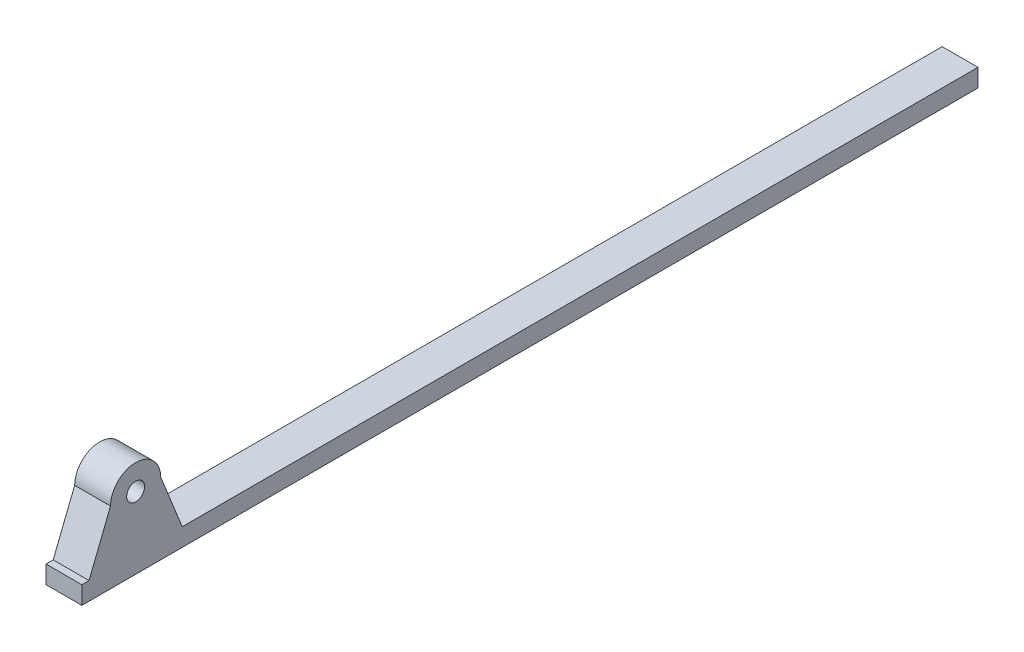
ISO-10303-21;
HEADER;
FILE_DESCRIPTION(('STEP AP214'),'2;1');
FILE_NAME('part.step','',(''),(''),'','','');
FILE_SCHEMA(('AUTOMOTIVE_DESIGN { 1 0 10303 214 1 1 1 1 }'));
ENDSEC;
DATA;
#1=APPLICATION_CONTEXT('core data for automotive mechanical design processes');
#2=APPLICATION_PROTOCOL_DEFINITION('international standard','automotive_design',2000,#1);
#3=PRODUCT_CONTEXT('',#1,'mechanical');
#4=PRODUCT('Part','Part','',(#3));
#5=PRODUCT_RELATED_PRODUCT_CATEGORY('part','',(#4));
#6=PRODUCT_DEFINITION_FORMATION('','',#4);
#7=PRODUCT_DEFINITION_CONTEXT('part definition',#1,'design');
#8=PRODUCT_DEFINITION('design','',#6,#7);
#9=PRODUCT_DEFINITION_SHAPE('','',#8);
#10=(LENGTH_UNIT() NAMED_UNIT(*) SI_UNIT(.MILLI.,.METRE.));
#11=(NAMED_UNIT(*) PLANE_ANGLE_UNIT() SI_UNIT($,.RADIAN.));
#12=(NAMED_UNIT(*) SI_UNIT($,.STERADIAN.) SOLID_ANGLE_UNIT());
#13=UNCERTAINTY_MEASURE_WITH_UNIT(LENGTH_MEASURE(1.E-05),#10,'distance_accuracy_value','');
#14=(GEOMETRIC_REPRESENTATION_CONTEXT(3) GLOBAL_UNCERTAINTY_ASSIGNED_CONTEXT((#13)) GLOBAL_UNIT_ASSIGNED_CONTEXT((#10,
#11,#12)) REPRESENTATION_CONTEXT('',''));
#15=CARTESIAN_POINT('',(0.,0.,0.));
#16=DIRECTION('',(0.,0.,1.));
#17=DIRECTION('',(1.,0.,0.));
#18=AXIS2_PLACEMENT_3D('',#15,#16,#17);
#19=CARTESIAN_POINT('',(5.,17.5,110.));
#20=DIRECTION('',(1.,0.,0.));
#21=DIRECTION('',(0.,0.,-1.));
#22=AXIS2_PLACEMENT_3D('',#19,#20,#21);
#23=PLANE('',#22);
#24=DIRECTION('',(0.,0.,1.));
#25=VECTOR('',#24,1.);
#26=CARTESIAN_POINT('',(5.,2.49999999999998,123.));
#27=LINE('',#26,#25);
#28=CARTESIAN_POINT('',(5.,2.49999999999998,123.));
#29=VERTEX_POINT('',#28);
#30=CARTESIAN_POINT('',(5.,2.49999999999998,125.));
#31=VERTEX_POINT('',#30);
#32=EDGE_CURVE('E155',#29,#31,#27,.T.);
#33=ORIENTED_EDGE('',*,*,#32,.T.);
#34=DIRECTION('',(0.,-1.,0.));
#35=VECTOR('',#34,1.);
#36=CARTESIAN_POINT('',(5.,-2.50000000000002,125.));
#37=LINE('',#36,#35);
#38=CARTESIAN_POINT('',(5.,-2.50000000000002,125.));
#39=VERTEX_POINT('',#38);
#40=EDGE_CURVE('E103',#31,#39,#37,.T.);
#41=ORIENTED_EDGE('',*,*,#40,.T.);
#42=DIRECTION('',(0.,0.,-1.));
#43=VECTOR('',#42,1.);
#44=CARTESIAN_POINT('',(5.,-2.49999999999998,-125.));
#45=LINE('',#44,#43);
#46=CARTESIAN_POINT('',(5.,-2.49999999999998,-125.));
#47=VERTEX_POINT('',#46);
#48=EDGE_CURVE('E170',#39,#47,#45,.T.);
#49=ORIENTED_EDGE('',*,*,#48,.T.);
#50=DIRECTION('',(0.,1.,0.));
#51=VECTOR('',#50,1.);
#52=CARTESIAN_POINT('',(5.,-2.49999999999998,-125.));
#53=LINE('',#52,#51);
#54=CARTESIAN_POINT('',(5.,2.50000000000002,-125.));
#55=VERTEX_POINT('',#54);
#56=EDGE_CURVE('E183',#47,#55,#53,.T.);
#57=ORIENTED_EDGE('',*,*,#56,.T.);
#58=DIRECTION('',(0.,0.,1.));
#59=VECTOR('',#58,1.);
#60=CARTESIAN_POINT('',(5.,2.50000000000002,-125.));
#61=LINE('',#60,#59);
#62=CARTESIAN_POINT('',(5.,2.49999999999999,97.));
#63=VERTEX_POINT('',#62);
#64=EDGE_CURVE('E122',#55,#63,#61,.T.);
#65=ORIENTED_EDGE('',*,*,#64,.T.);
#66=DIRECTION('',(0.,0.92847669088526,0.371390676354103));
#67=VECTOR('',#66,1.);
#68=CARTESIAN_POINT('',(5.,17.5,103.));
#69=LINE('',#68,#67);
#70=CARTESIAN_POINT('',(5.,17.5,103.));
#71=VERTEX_POINT('',#70);
#72=EDGE_CURVE('E116',#63,#71,#69,.T.);
#73=ORIENTED_EDGE('',*,*,#72,.T.);
#74=CARTESIAN_POINT('',(5.,17.5,110.));
#75=DIRECTION('',(1.,0.,0.));
#76=DIRECTION('',(0.,0.,-1.));
#77=AXIS2_PLACEMENT_3D('',#74,#75,#76);
#78=CIRCLE('',#77,7.00000000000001);
#79=CARTESIAN_POINT('',(5.,17.5,117.));
#80=VERTEX_POINT('',#79);
#81=EDGE_CURVE('E120',#71,#80,#78,.T.);
#82=ORIENTED_EDGE('',*,*,#81,.T.);
#83=DIRECTION('',(0.,-0.92847669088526,0.371390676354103));
#84=VECTOR('',#83,1.);
#85=CARTESIAN_POINT('',(5.,17.5,117.));
#86=LINE('',#85,#84);
#87=EDGE_CURVE('E60',#80,#29,#86,.T.);
#88=ORIENTED_EDGE('',*,*,#87,.T.);
#89=EDGE_LOOP('',(#33,#41,#49,#57,#65,#73,#82,#88));
#90=FACE_BOUND('',#89,.T.);
#91=CARTESIAN_POINT('',(5.,17.5,110.));
#92=DIRECTION('',(1.,0.,0.));
#93=DIRECTION('',(0.,0.,-1.));
#94=AXIS2_PLACEMENT_3D('',#91,#92,#93);
#95=CIRCLE('',#94,2.50000000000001);
#96=CARTESIAN_POINT('',(5.,17.5,107.5));
#97=VERTEX_POINT('',#96);
#98=EDGE_CURVE('E144',#97,#97,#95,.T.);
#99=ORIENTED_EDGE('',*,*,#98,.F.);
#100=EDGE_LOOP('',(#99));
#101=FACE_BOUND('',#100,.T.);
#102=ADVANCED_FACE('F43',(#90,#101),#23,.T.);
#103=CARTESIAN_POINT('',(-5.,17.5,110.));
#104=DIRECTION('',(1.,0.,0.));
#105=DIRECTION('',(0.,0.,-1.));
#106=AXIS2_PLACEMENT_3D('',#103,#104,#105);
#107=PLANE('',#106);
#108=DIRECTION('',(0.,0.,1.));
#109=VECTOR('',#108,1.);
#110=CARTESIAN_POINT('',(-5.,2.49999999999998,123.));
#111=LINE('',#110,#109);
#112=CARTESIAN_POINT('',(-5.,2.49999999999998,123.));
#113=VERTEX_POINT('',#112);
#114=CARTESIAN_POINT('',(-5.,2.49999999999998,125.));
#115=VERTEX_POINT('',#114);
#116=EDGE_CURVE('E140',#113,#115,#111,.T.);
#117=ORIENTED_EDGE('',*,*,#116,.F.);
#118=DIRECTION('',(0.,-0.92847669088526,0.371390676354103));
#119=VECTOR('',#118,1.);
#120=CARTESIAN_POINT('',(-5.,17.5,117.));
#121=LINE('',#120,#119);
#122=CARTESIAN_POINT('',(-5.,17.5,117.));
#123=VERTEX_POINT('',#122);
#124=EDGE_CURVE('E95',#123,#113,#121,.T.);
#125=ORIENTED_EDGE('',*,*,#124,.F.);
#126=CARTESIAN_POINT('',(-5.,17.5,110.));
#127=DIRECTION('',(1.,0.,0.));
#128=DIRECTION('',(0.,0.,-1.));
#129=AXIS2_PLACEMENT_3D('',#126,#127,#128);
#130=CIRCLE('',#129,7.00000000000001);
#131=CARTESIAN_POINT('',(-5.,17.5,103.));
#132=VERTEX_POINT('',#131);
#133=EDGE_CURVE('E89',#132,#123,#130,.T.);
#134=ORIENTED_EDGE('',*,*,#133,.F.);
#135=DIRECTION('',(0.,0.92847669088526,0.371390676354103));
#136=VECTOR('',#135,1.);
#137=CARTESIAN_POINT('',(-5.,17.5,103.));
#138=LINE('',#137,#136);
#139=CARTESIAN_POINT('',(-5.,2.49999999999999,97.));
#140=VERTEX_POINT('',#139);
#141=EDGE_CURVE('E130',#140,#132,#138,.T.);
#142=ORIENTED_EDGE('',*,*,#141,.F.);
#143=DIRECTION('',(0.,0.,1.));
#144=VECTOR('',#143,1.);
#145=CARTESIAN_POINT('',(-5.,2.50000000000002,-125.));
#146=LINE('',#145,#144);
#147=CARTESIAN_POINT('',(-5.,2.50000000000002,-125.));
#148=VERTEX_POINT('',#147);
#149=EDGE_CURVE('E150',#148,#140,#146,.T.);
#150=ORIENTED_EDGE('',*,*,#149,.F.);
#151=DIRECTION('',(0.,1.,0.));
#152=VECTOR('',#151,1.);
#153=CARTESIAN_POINT('',(-5.,-2.49999999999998,-125.));
#154=LINE('',#153,#152);
#155=CARTESIAN_POINT('',(-5.,-2.49999999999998,-125.));
#156=VERTEX_POINT('',#155);
#157=EDGE_CURVE('E148',#156,#148,#154,.T.);
#158=ORIENTED_EDGE('',*,*,#157,.F.);
#159=DIRECTION('',(0.,0.,-1.));
#160=VECTOR('',#159,1.);
#161=CARTESIAN_POINT('',(-5.,-2.49999999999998,-125.));
#162=LINE('',#161,#160);
#163=CARTESIAN_POINT('',(-5.,-2.50000000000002,125.));
#164=VERTEX_POINT('',#163);
#165=EDGE_CURVE('E146',#164,#156,#162,.T.);
#166=ORIENTED_EDGE('',*,*,#165,.F.);
#167=DIRECTION('',(0.,-1.,0.));
#168=VECTOR('',#167,1.);
#169=CARTESIAN_POINT('',(-5.,-2.50000000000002,125.));
#170=LINE('',#169,#168);
#171=EDGE_CURVE('E143',#115,#164,#170,.T.);
#172=ORIENTED_EDGE('',*,*,#171,.F.);
#173=EDGE_LOOP('',(#117,#125,#134,#142,#150,#158,#166,#172));
#174=FACE_BOUND('',#173,.T.);
#175=CARTESIAN_POINT('',(-5.,17.5,110.));
#176=DIRECTION('',(1.,0.,0.));
#177=DIRECTION('',(0.,0.,-1.));
#178=AXIS2_PLACEMENT_3D('',#175,#176,#177);
#179=CIRCLE('',#178,2.50000000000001);
#180=CARTESIAN_POINT('',(-5.,17.5,107.5));
#181=VERTEX_POINT('',#180);
#182=EDGE_CURVE('E189',#181,#181,#179,.T.);
#183=ORIENTED_EDGE('',*,*,#182,.T.);
#184=EDGE_LOOP('',(#183));
#185=FACE_BOUND('',#184,.T.);
#186=ADVANCED_FACE('F174',(#174,#185),#107,.F.);
#187=CARTESIAN_POINT('',(5.,2.49999999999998,123.));
#188=DIRECTION('',(0.,-1.,0.));
#189=DIRECTION('',(0.,0.,-1.));
#190=AXIS2_PLACEMENT_3D('',#187,#188,#189);
#191=PLANE('',#190);
#192=ORIENTED_EDGE('',*,*,#116,.T.);
#193=DIRECTION('',(-1.,0.,0.));
#194=VECTOR('',#193,1.);
#195=CARTESIAN_POINT('',(5.,2.49999999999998,125.));
#196=LINE('',#195,#194);
#197=EDGE_CURVE('E11',#31,#115,#196,.T.);
#198=ORIENTED_EDGE('',*,*,#197,.F.);
#199=ORIENTED_EDGE('',*,*,#32,.F.);
#200=DIRECTION('',(-1.,0.,0.));
#201=VECTOR('',#200,1.);
#202=CARTESIAN_POINT('',(5.,2.49999999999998,123.));
#203=LINE('',#202,#201);
#204=EDGE_CURVE('E136',#29,#113,#203,.T.);
#205=ORIENTED_EDGE('',*,*,#204,.T.);
#206=EDGE_LOOP('',(#192,#198,#199,#205));
#207=FACE_BOUND('',#206,.T.);
#208=ADVANCED_FACE('F45',(#207),#191,.F.);
#209=CARTESIAN_POINT('',(5.,-2.50000000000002,125.));
#210=DIRECTION('',(0.,0.,-1.));
#211=DIRECTION('',(-1.,0.,0.));
#212=AXIS2_PLACEMENT_3D('',#209,#210,#211);
#213=PLANE('',#212);
#214=ORIENTED_EDGE('',*,*,#171,.T.);
#215=DIRECTION('',(-1.,0.,0.));
#216=VECTOR('',#215,1.);
#217=CARTESIAN_POINT('',(5.,-2.50000000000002,125.));
#218=LINE('',#217,#216);
#219=EDGE_CURVE('E52',#39,#164,#218,.T.);
#220=ORIENTED_EDGE('',*,*,#219,.F.);
#221=ORIENTED_EDGE('',*,*,#40,.F.);
#222=ORIENTED_EDGE('',*,*,#197,.T.);
#223=EDGE_LOOP('',(#214,#220,#221,#222));
#224=FACE_BOUND('',#223,.T.);
#225=ADVANCED_FACE('F217',(#224),#213,.F.);
#226=CARTESIAN_POINT('',(5.,-2.49999999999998,-125.));
#227=DIRECTION('',(0.,1.,0.));
#228=DIRECTION('',(0.,0.,1.));
#229=AXIS2_PLACEMENT_3D('',#226,#227,#228);
#230=PLANE('',#229);
#231=ORIENTED_EDGE('',*,*,#165,.T.);
#232=DIRECTION('',(-1.,0.,0.));
#233=VECTOR('',#232,1.);
#234=CARTESIAN_POINT('',(5.,-2.49999999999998,-125.));
#235=LINE('',#234,#233);
#236=EDGE_CURVE('E162',#47,#156,#235,.T.);
#237=ORIENTED_EDGE('',*,*,#236,.F.);
#238=ORIENTED_EDGE('',*,*,#48,.F.);
#239=ORIENTED_EDGE('',*,*,#219,.T.);
#240=EDGE_LOOP('',(#231,#237,#238,#239));
#241=FACE_BOUND('',#240,.T.);
#242=ADVANCED_FACE('F168',(#241),#230,.F.);
#243=CARTESIAN_POINT('',(5.,-2.49999999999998,-125.));
#244=DIRECTION('',(0.,0.,1.));
#245=DIRECTION('',(1.,0.,0.));
#246=AXIS2_PLACEMENT_3D('',#243,#244,#245);
#247=PLANE('',#246);
#248=ORIENTED_EDGE('',*,*,#157,.T.);
#249=DIRECTION('',(-1.,0.,0.));
#250=VECTOR('',#249,1.);
#251=CARTESIAN_POINT('',(5.,2.50000000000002,-125.));
#252=LINE('',#251,#250);
#253=EDGE_CURVE('E159',#55,#148,#252,.T.);
#254=ORIENTED_EDGE('',*,*,#253,.F.);
#255=ORIENTED_EDGE('',*,*,#56,.F.);
#256=ORIENTED_EDGE('',*,*,#236,.T.);
#257=EDGE_LOOP('',(#248,#254,#255,#256));
#258=FACE_BOUND('',#257,.T.);
#259=ADVANCED_FACE('F179',(#258),#247,.F.);
#260=CARTESIAN_POINT('',(5.,2.50000000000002,-125.));
#261=DIRECTION('',(0.,-1.,0.));
#262=DIRECTION('',(0.,0.,-1.));
#263=AXIS2_PLACEMENT_3D('',#260,#261,#262);
#264=PLANE('',#263);
#265=ORIENTED_EDGE('',*,*,#149,.T.);
#266=DIRECTION('',(-1.,0.,0.));
#267=VECTOR('',#266,1.);
#268=CARTESIAN_POINT('',(5.,2.49999999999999,97.));
#269=LINE('',#268,#267);
#270=EDGE_CURVE('E131',#63,#140,#269,.T.);
#271=ORIENTED_EDGE('',*,*,#270,.F.);
#272=ORIENTED_EDGE('',*,*,#64,.F.);
#273=ORIENTED_EDGE('',*,*,#253,.T.);
#274=EDGE_LOOP('',(#265,#271,#272,#273));
#275=FACE_BOUND('',#274,.T.);
#276=ADVANCED_FACE('F182',(#275),#264,.F.);
#277=CARTESIAN_POINT('',(5.,17.5,103.));
#278=DIRECTION('',(0.,-0.371390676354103,0.92847669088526));
#279=DIRECTION('',(0.,-0.92847669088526,-0.371390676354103));
#280=AXIS2_PLACEMENT_3D('',#277,#278,#279);
#281=PLANE('',#280);
#282=ORIENTED_EDGE('',*,*,#141,.T.);
#283=DIRECTION('',(-1.,0.,0.));
#284=VECTOR('',#283,1.);
#285=CARTESIAN_POINT('',(5.,17.5,103.));
#286=LINE('',#285,#284);
#287=EDGE_CURVE('E127',#71,#132,#286,.T.);
#288=ORIENTED_EDGE('',*,*,#287,.F.);
#289=ORIENTED_EDGE('',*,*,#72,.F.);
#290=ORIENTED_EDGE('',*,*,#270,.T.);
#291=EDGE_LOOP('',(#282,#288,#289,#290));
#292=FACE_BOUND('',#291,.T.);
#293=ADVANCED_FACE('F128',(#292),#281,.F.);
#294=CARTESIAN_POINT('',(5.,17.5,110.));
#295=DIRECTION('',(-1.,0.,0.));
#296=DIRECTION('',(0.,0.,1.));
#297=AXIS2_PLACEMENT_3D('',#294,#295,#296);
#298=CYLINDRICAL_SURFACE('',#297,7.00000000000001);
#299=ORIENTED_EDGE('',*,*,#133,.T.);
#300=DIRECTION('',(-1.,0.,0.));
#301=VECTOR('',#300,1.);
#302=CARTESIAN_POINT('',(5.,17.5,117.));
#303=LINE('',#302,#301);
#304=EDGE_CURVE('E132',#80,#123,#303,.T.);
#305=ORIENTED_EDGE('',*,*,#304,.F.);
#306=ORIENTED_EDGE('',*,*,#81,.F.);
#307=ORIENTED_EDGE('',*,*,#287,.T.);
#308=EDGE_LOOP('',(#299,#305,#306,#307));
#309=FACE_BOUND('',#308,.T.);
#310=ADVANCED_FACE('F134',(#309),#298,.T.);
#311=CARTESIAN_POINT('',(5.,17.5,117.));
#312=DIRECTION('',(0.,-0.371390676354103,-0.92847669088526));
#313=DIRECTION('',(0.,0.92847669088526,-0.371390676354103));
#314=AXIS2_PLACEMENT_3D('',#311,#312,#313);
#315=PLANE('',#314);
#316=ORIENTED_EDGE('',*,*,#124,.T.);
#317=ORIENTED_EDGE('',*,*,#204,.F.);
#318=ORIENTED_EDGE('',*,*,#87,.F.);
#319=ORIENTED_EDGE('',*,*,#304,.T.);
#320=EDGE_LOOP('',(#316,#317,#318,#319));
#321=FACE_BOUND('',#320,.T.);
#322=ADVANCED_FACE('F205',(#321),#315,.F.);
#323=CARTESIAN_POINT('',(5.,17.5,110.));
#324=DIRECTION('',(-1.,0.,0.));
#325=DIRECTION('',(0.,0.,1.));
#326=AXIS2_PLACEMENT_3D('',#323,#324,#325);
#327=CYLINDRICAL_SURFACE('',#326,2.50000000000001);
#328=ORIENTED_EDGE('',*,*,#98,.T.);
#329=EDGE_LOOP('',(#328));
#330=FACE_BOUND('',#329,.T.);
#331=ORIENTED_EDGE('',*,*,#182,.F.);
#332=EDGE_LOOP('',(#331));
#333=FACE_BOUND('',#332,.T.);
#334=ADVANCED_FACE('F195',(#330,#333),#327,.F.);
#335=CLOSED_SHELL('',(#102,#186,#208,#225,#242,#259,#276,#293,#310,#322,#334));
#336=MANIFOLD_SOLID_BREP('B2',#335);
#337=ADVANCED_BREP_SHAPE_REPRESENTATION('',(#18,#336),#14);
#338=SHAPE_DEFINITION_REPRESENTATION(#9,#337);
ENDSEC;
END-ISO-10303-21;
